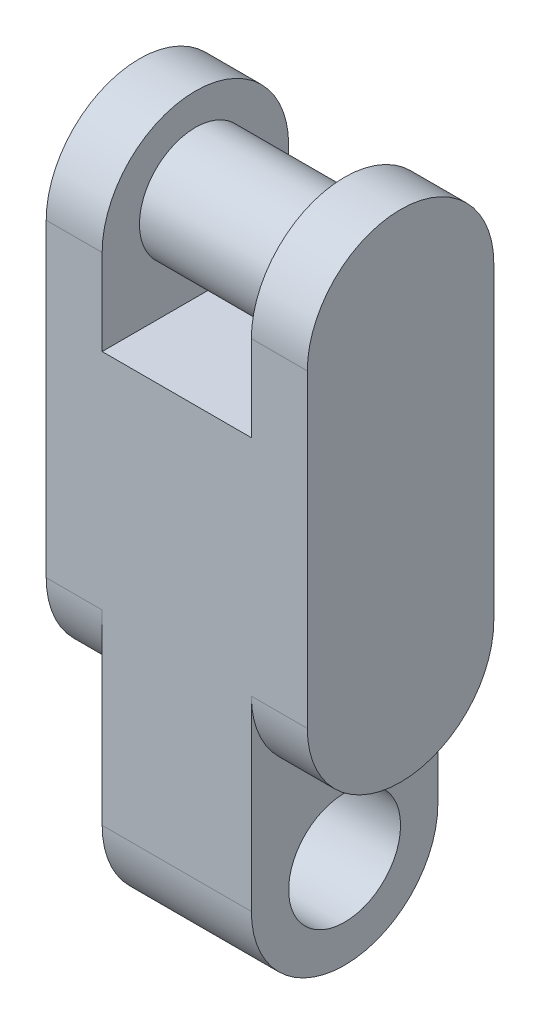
ISO-10303-21;
HEADER;
FILE_DESCRIPTION(('STEP AP214'),'2;1');
FILE_NAME('part.step','',(''),(''),'','','');
FILE_SCHEMA(('AUTOMOTIVE_DESIGN { 1 0 10303 214 1 1 1 1 }'));
ENDSEC;
DATA;
#1=APPLICATION_CONTEXT('core data for automotive mechanical design processes');
#2=APPLICATION_PROTOCOL_DEFINITION('international standard','automotive_design',2000,#1);
#3=PRODUCT_CONTEXT('',#1,'mechanical');
#4=PRODUCT('Part','Part','',(#3));
#5=PRODUCT_RELATED_PRODUCT_CATEGORY('part','',(#4));
#6=PRODUCT_DEFINITION_FORMATION('','',#4);
#7=PRODUCT_DEFINITION_CONTEXT('part definition',#1,'design');
#8=PRODUCT_DEFINITION('design','',#6,#7);
#9=PRODUCT_DEFINITION_SHAPE('','',#8);
#10=(LENGTH_UNIT() NAMED_UNIT(*) SI_UNIT(.MILLI.,.METRE.));
#11=(NAMED_UNIT(*) PLANE_ANGLE_UNIT() SI_UNIT($,.RADIAN.));
#12=(NAMED_UNIT(*) SI_UNIT($,.STERADIAN.) SOLID_ANGLE_UNIT());
#13=UNCERTAINTY_MEASURE_WITH_UNIT(LENGTH_MEASURE(1.E-05),#10,'distance_accuracy_value','');
#14=(GEOMETRIC_REPRESENTATION_CONTEXT(3) GLOBAL_UNCERTAINTY_ASSIGNED_CONTEXT((#13)) GLOBAL_UNIT_ASSIGNED_CONTEXT((#10,
#11,#12)) REPRESENTATION_CONTEXT('',''));
#15=CARTESIAN_POINT('',(0.,0.,0.));
#16=DIRECTION('',(0.,0.,1.));
#17=DIRECTION('',(1.,0.,0.));
#18=AXIS2_PLACEMENT_3D('',#15,#16,#17);
#19=CARTESIAN_POINT('',(-44.9450143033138,10.4453041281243,10.));
#20=DIRECTION('',(-1.,0.,0.));
#21=DIRECTION('',(0.,0.,1.));
#22=AXIS2_PLACEMENT_3D('',#19,#20,#21);
#23=PLANE('',#22);
#24=CARTESIAN_POINT('',(-44.9450143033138,15.4453041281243,5.));
#25=DIRECTION('',(1.,0.,0.));
#26=DIRECTION('',(0.,0.,-1.));
#27=AXIS2_PLACEMENT_3D('',#24,#25,#26);
#28=CIRCLE('',#27,5.);
#29=CARTESIAN_POINT('',(-44.9450143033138,15.4453041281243,10.));
#30=VERTEX_POINT('',#29);
#31=CARTESIAN_POINT('',(-44.9450143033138,15.4453041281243,0.));
#32=VERTEX_POINT('',#31);
#33=EDGE_CURVE('E219',#30,#32,#28,.T.);
#34=ORIENTED_EDGE('',*,*,#33,.T.);
#35=DIRECTION('',(0.,1.,0.));
#36=VECTOR('',#35,1.);
#37=CARTESIAN_POINT('',(-44.9450143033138,10.4453041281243,0.));
#38=LINE('',#37,#36);
#39=CARTESIAN_POINT('',(-44.9450143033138,32.0453041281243,0.));
#40=VERTEX_POINT('',#39);
#41=EDGE_CURVE('E152',#32,#40,#38,.T.);
#42=ORIENTED_EDGE('',*,*,#41,.T.);
#43=CARTESIAN_POINT('',(-44.9450143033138,32.0453041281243,5.));
#44=DIRECTION('',(-1.,0.,0.));
#45=DIRECTION('',(0.,0.,1.));
#46=AXIS2_PLACEMENT_3D('',#43,#44,#45);
#47=CIRCLE('',#46,5.);
#48=CARTESIAN_POINT('',(-44.9450143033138,32.0453041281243,10.));
#49=VERTEX_POINT('',#48);
#50=EDGE_CURVE('E321',#49,#40,#47,.T.);
#51=ORIENTED_EDGE('',*,*,#50,.F.);
#52=DIRECTION('',(0.,1.,0.));
#53=VECTOR('',#52,1.);
#54=CARTESIAN_POINT('',(-44.9450143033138,10.4453041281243,10.));
#55=LINE('',#54,#53);
#56=EDGE_CURVE('E221',#30,#49,#55,.T.);
#57=ORIENTED_EDGE('',*,*,#56,.F.);
#58=EDGE_LOOP('',(#34,#42,#51,#57));
#59=FACE_BOUND('',#58,.T.);
#60=ADVANCED_FACE('F129',(#59),#23,.F.);
#61=CARTESIAN_POINT('',(-58.9450143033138,37.0453041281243,10.));
#62=DIRECTION('',(1.,0.,0.));
#63=DIRECTION('',(0.,0.,-1.));
#64=AXIS2_PLACEMENT_3D('',#61,#62,#63);
#65=PLANE('',#64);
#66=CARTESIAN_POINT('',(-58.9450143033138,15.4453041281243,5.));
#67=DIRECTION('',(-1.,0.,0.));
#68=DIRECTION('',(0.,0.,1.));
#69=AXIS2_PLACEMENT_3D('',#66,#67,#68);
#70=CIRCLE('',#69,5.);
#71=CARTESIAN_POINT('',(-58.9450143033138,15.4453041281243,0.));
#72=VERTEX_POINT('',#71);
#73=CARTESIAN_POINT('',(-58.9450143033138,15.4453041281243,10.));
#74=VERTEX_POINT('',#73);
#75=EDGE_CURVE('E282',#72,#74,#70,.T.);
#76=ORIENTED_EDGE('',*,*,#75,.T.);
#77=DIRECTION('',(0.,-1.,0.));
#78=VECTOR('',#77,1.);
#79=CARTESIAN_POINT('',(-58.9450143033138,37.0453041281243,10.));
#80=LINE('',#79,#78);
#81=CARTESIAN_POINT('',(-58.9450143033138,32.0453041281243,10.));
#82=VERTEX_POINT('',#81);
#83=EDGE_CURVE('E250',#82,#74,#80,.T.);
#84=ORIENTED_EDGE('',*,*,#83,.F.);
#85=CARTESIAN_POINT('',(-58.9450143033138,32.0453041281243,5.));
#86=DIRECTION('',(-1.,0.,0.));
#87=DIRECTION('',(0.,0.,1.));
#88=AXIS2_PLACEMENT_3D('',#85,#86,#87);
#89=CIRCLE('',#88,5.);
#90=CARTESIAN_POINT('',(-58.9450143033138,32.0453041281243,0.));
#91=VERTEX_POINT('',#90);
#92=EDGE_CURVE('E280',#82,#91,#89,.T.);
#93=ORIENTED_EDGE('',*,*,#92,.T.);
#94=DIRECTION('',(0.,-1.,0.));
#95=VECTOR('',#94,1.);
#96=CARTESIAN_POINT('',(-58.9450143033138,37.0453041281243,0.));
#97=LINE('',#96,#95);
#98=EDGE_CURVE('E300',#91,#72,#97,.T.);
#99=ORIENTED_EDGE('',*,*,#98,.T.);
#100=EDGE_LOOP('',(#76,#84,#93,#99));
#101=FACE_BOUND('',#100,.T.);
#102=ADVANCED_FACE('F131',(#101),#65,.F.);
#103=CARTESIAN_POINT('',(0.,0.,10.));
#104=DIRECTION('',(0.,0.,-1.));
#105=DIRECTION('',(-1.,0.,0.));
#106=AXIS2_PLACEMENT_3D('',#103,#104,#105);
#107=PLANE('',#106);
#108=DIRECTION('',(0.,1.,0.));
#109=VECTOR('',#108,1.);
#110=CARTESIAN_POINT('',(-47.9450143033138,10.4453041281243,10.));
#111=LINE('',#110,#109);
#112=CARTESIAN_POINT('',(-47.9450143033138,5.44530412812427,10.));
#113=VERTEX_POINT('',#112);
#114=CARTESIAN_POINT('',(-47.9450143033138,15.4453041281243,10.));
#115=VERTEX_POINT('',#114);
#116=EDGE_CURVE('E287',#113,#115,#111,.T.);
#117=ORIENTED_EDGE('',*,*,#116,.T.);
#118=DIRECTION('',(1.,0.,0.));
#119=VECTOR('',#118,1.);
#120=CARTESIAN_POINT('',(-47.9450143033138,15.4453041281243,10.));
#121=LINE('',#120,#119);
#122=EDGE_CURVE('E348',#115,#30,#121,.T.);
#123=ORIENTED_EDGE('',*,*,#122,.T.);
#124=ORIENTED_EDGE('',*,*,#56,.T.);
#125=DIRECTION('',(-1.,0.,0.));
#126=VECTOR('',#125,1.);
#127=CARTESIAN_POINT('',(-37.9450143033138,32.0453041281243,10.));
#128=LINE('',#127,#126);
#129=CARTESIAN_POINT('',(-47.9450143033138,32.0453041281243,10.));
#130=VERTEX_POINT('',#129);
#131=EDGE_CURVE('E12',#49,#130,#128,.T.);
#132=ORIENTED_EDGE('',*,*,#131,.T.);
#133=DIRECTION('',(0.,-1.,0.));
#134=VECTOR('',#133,1.);
#135=CARTESIAN_POINT('',(-47.9450143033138,27.446470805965,10.));
#136=LINE('',#135,#134);
#137=CARTESIAN_POINT('',(-47.9450143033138,27.446470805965,10.));
#138=VERTEX_POINT('',#137);
#139=EDGE_CURVE('E295',#130,#138,#136,.T.);
#140=ORIENTED_EDGE('',*,*,#139,.T.);
#141=DIRECTION('',(-1.,0.,0.));
#142=VECTOR('',#141,1.);
#143=CARTESIAN_POINT('',(-55.9450143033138,27.446470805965,10.));
#144=LINE('',#143,#142);
#145=CARTESIAN_POINT('',(-55.9450143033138,27.446470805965,10.));
#146=VERTEX_POINT('',#145);
#147=EDGE_CURVE('E297',#138,#146,#144,.T.);
#148=ORIENTED_EDGE('',*,*,#147,.T.);
#149=DIRECTION('',(0.,1.,0.));
#150=VECTOR('',#149,1.);
#151=CARTESIAN_POINT('',(-55.9450143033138,37.0453041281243,10.));
#152=LINE('',#151,#150);
#153=CARTESIAN_POINT('',(-55.9450143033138,32.0453041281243,10.));
#154=VERTEX_POINT('',#153);
#155=EDGE_CURVE('E255',#146,#154,#152,.T.);
#156=ORIENTED_EDGE('',*,*,#155,.T.);
#157=EDGE_CURVE('E133',#154,#82,#128,.T.);
#158=ORIENTED_EDGE('',*,*,#157,.T.);
#159=ORIENTED_EDGE('',*,*,#83,.T.);
#160=DIRECTION('',(-1.,0.,0.));
#161=VECTOR('',#160,1.);
#162=CARTESIAN_POINT('',(-55.9450143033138,15.4453041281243,10.));
#163=LINE('',#162,#161);
#164=CARTESIAN_POINT('',(-55.9450143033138,15.4453041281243,10.));
#165=VERTEX_POINT('',#164);
#166=EDGE_CURVE('E347',#165,#74,#163,.T.);
#167=ORIENTED_EDGE('',*,*,#166,.F.);
#168=DIRECTION('',(0.,-1.,0.));
#169=VECTOR('',#168,1.);
#170=CARTESIAN_POINT('',(-55.9450143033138,0.445304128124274,10.));
#171=LINE('',#170,#169);
#172=CARTESIAN_POINT('',(-55.9450143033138,5.44530412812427,10.));
#173=VERTEX_POINT('',#172);
#174=EDGE_CURVE('E284',#165,#173,#171,.T.);
#175=ORIENTED_EDGE('',*,*,#174,.T.);
#176=DIRECTION('',(1.,0.,0.));
#177=VECTOR('',#176,1.);
#178=CARTESIAN_POINT('',(-55.9450143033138,5.44530412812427,10.));
#179=LINE('',#178,#177);
#180=EDGE_CURVE('E328',#173,#113,#179,.T.);
#181=ORIENTED_EDGE('',*,*,#180,.T.);
#182=EDGE_LOOP('',(#117,#123,#124,#132,#140,#148,#156,#158,#159,#167,#175,#181));
#183=FACE_BOUND('',#182,.T.);
#184=ADVANCED_FACE('F275',(#183),#107,.F.);
#185=CARTESIAN_POINT('',(0.,0.,0.));
#186=DIRECTION('',(0.,0.,-1.));
#187=DIRECTION('',(-1.,0.,0.));
#188=AXIS2_PLACEMENT_3D('',#185,#186,#187);
#189=PLANE('',#188);
#190=DIRECTION('',(1.,0.,0.));
#191=VECTOR('',#190,1.);
#192=CARTESIAN_POINT('',(-47.9450143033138,15.4453041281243,0.));
#193=LINE('',#192,#191);
#194=CARTESIAN_POINT('',(-47.9450143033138,15.4453041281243,0.));
#195=VERTEX_POINT('',#194);
#196=EDGE_CURVE('E226',#195,#32,#193,.T.);
#197=ORIENTED_EDGE('',*,*,#196,.F.);
#198=DIRECTION('',(0.,1.,0.));
#199=VECTOR('',#198,1.);
#200=CARTESIAN_POINT('',(-47.9450143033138,10.4453041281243,0.));
#201=LINE('',#200,#199);
#202=CARTESIAN_POINT('',(-47.9450143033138,5.44530412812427,0.));
#203=VERTEX_POINT('',#202);
#204=EDGE_CURVE('E239',#203,#195,#201,.T.);
#205=ORIENTED_EDGE('',*,*,#204,.F.);
#206=DIRECTION('',(1.,0.,0.));
#207=VECTOR('',#206,1.);
#208=CARTESIAN_POINT('',(-55.9450143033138,5.44530412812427,0.));
#209=LINE('',#208,#207);
#210=CARTESIAN_POINT('',(-55.9450143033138,5.44530412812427,0.));
#211=VERTEX_POINT('',#210);
#212=EDGE_CURVE('E323',#211,#203,#209,.T.);
#213=ORIENTED_EDGE('',*,*,#212,.F.);
#214=DIRECTION('',(0.,-1.,0.));
#215=VECTOR('',#214,1.);
#216=CARTESIAN_POINT('',(-55.9450143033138,0.445304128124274,0.));
#217=LINE('',#216,#215);
#218=CARTESIAN_POINT('',(-55.9450143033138,15.4453041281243,0.));
#219=VERTEX_POINT('',#218);
#220=EDGE_CURVE('E144',#219,#211,#217,.T.);
#221=ORIENTED_EDGE('',*,*,#220,.F.);
#222=DIRECTION('',(-1.,0.,0.));
#223=VECTOR('',#222,1.);
#224=CARTESIAN_POINT('',(-55.9450143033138,15.4453041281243,0.));
#225=LINE('',#224,#223);
#226=EDGE_CURVE('E310',#219,#72,#225,.T.);
#227=ORIENTED_EDGE('',*,*,#226,.T.);
#228=ORIENTED_EDGE('',*,*,#98,.F.);
#229=DIRECTION('',(-1.,0.,0.));
#230=VECTOR('',#229,1.);
#231=CARTESIAN_POINT('',(-37.9450143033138,32.0453041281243,0.));
#232=LINE('',#231,#230);
#233=CARTESIAN_POINT('',(-55.9450143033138,32.0453041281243,0.));
#234=VERTEX_POINT('',#233);
#235=EDGE_CURVE('E263',#234,#91,#232,.T.);
#236=ORIENTED_EDGE('',*,*,#235,.F.);
#237=DIRECTION('',(0.,1.,0.));
#238=VECTOR('',#237,1.);
#239=CARTESIAN_POINT('',(-55.9450143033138,37.0453041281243,0.));
#240=LINE('',#239,#238);
#241=CARTESIAN_POINT('',(-55.9450143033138,27.446470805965,0.));
#242=VERTEX_POINT('',#241);
#243=EDGE_CURVE('E247',#242,#234,#240,.T.);
#244=ORIENTED_EDGE('',*,*,#243,.F.);
#245=DIRECTION('',(-1.,0.,0.));
#246=VECTOR('',#245,1.);
#247=CARTESIAN_POINT('',(-55.9450143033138,27.446470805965,0.));
#248=LINE('',#247,#246);
#249=CARTESIAN_POINT('',(-47.9450143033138,27.446470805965,0.));
#250=VERTEX_POINT('',#249);
#251=EDGE_CURVE('E241',#250,#242,#248,.T.);
#252=ORIENTED_EDGE('',*,*,#251,.F.);
#253=DIRECTION('',(0.,-1.,0.));
#254=VECTOR('',#253,1.);
#255=CARTESIAN_POINT('',(-47.9450143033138,27.446470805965,0.));
#256=LINE('',#255,#254);
#257=CARTESIAN_POINT('',(-47.9450143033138,32.0453041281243,0.));
#258=VERTEX_POINT('',#257);
#259=EDGE_CURVE('E238',#258,#250,#256,.T.);
#260=ORIENTED_EDGE('',*,*,#259,.F.);
#261=EDGE_CURVE('E237',#40,#258,#232,.T.);
#262=ORIENTED_EDGE('',*,*,#261,.F.);
#263=ORIENTED_EDGE('',*,*,#41,.F.);
#264=EDGE_LOOP('',(#197,#205,#213,#221,#227,#228,#236,#244,#252,#260,#262,#263));
#265=FACE_BOUND('',#264,.T.);
#266=ADVANCED_FACE('F235',(#265),#189,.T.);
#267=CARTESIAN_POINT('',(-47.9450143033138,27.446470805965,10.));
#268=DIRECTION('',(1.,0.,0.));
#269=DIRECTION('',(0.,0.,-1.));
#270=AXIS2_PLACEMENT_3D('',#267,#268,#269);
#271=PLANE('',#270);
#272=CARTESIAN_POINT('',(-47.9450143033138,32.3539598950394,5.));
#273=DIRECTION('',(1.,0.,0.));
#274=DIRECTION('',(0.,0.,-1.));
#275=AXIS2_PLACEMENT_3D('',#272,#273,#274);
#276=CIRCLE('',#275,3.);
#277=CARTESIAN_POINT('',(-47.9450143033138,32.3539598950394,2.));
#278=VERTEX_POINT('',#277);
#279=EDGE_CURVE('E261',#278,#278,#276,.F.);
#280=ORIENTED_EDGE('',*,*,#279,.F.);
#281=EDGE_LOOP('',(#280));
#282=FACE_BOUND('',#281,.T.);
#283=ORIENTED_EDGE('',*,*,#139,.F.);
#284=CARTESIAN_POINT('',(-47.9450143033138,32.0453041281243,5.));
#285=DIRECTION('',(1.,0.,0.));
#286=DIRECTION('',(0.,0.,-1.));
#287=AXIS2_PLACEMENT_3D('',#284,#285,#286);
#288=CIRCLE('',#287,5.);
#289=EDGE_CURVE('E319',#258,#130,#288,.T.);
#290=ORIENTED_EDGE('',*,*,#289,.F.);
#291=ORIENTED_EDGE('',*,*,#259,.T.);
#292=DIRECTION('',(0.,0.,-1.));
#293=VECTOR('',#292,1.);
#294=CARTESIAN_POINT('',(-47.9450143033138,27.446470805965,10.));
#295=LINE('',#294,#293);
#296=EDGE_CURVE('E254',#138,#250,#295,.T.);
#297=ORIENTED_EDGE('',*,*,#296,.F.);
#298=EDGE_LOOP('',(#283,#290,#291,#297));
#299=FACE_BOUND('',#298,.T.);
#300=ADVANCED_FACE('F356',(#282,#299),#271,.F.);
#301=CARTESIAN_POINT('',(-55.9450143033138,37.0453041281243,10.));
#302=DIRECTION('',(-1.,0.,0.));
#303=DIRECTION('',(0.,0.,1.));
#304=AXIS2_PLACEMENT_3D('',#301,#302,#303);
#305=PLANE('',#304);
#306=CARTESIAN_POINT('',(-55.9450143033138,32.3539598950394,5.));
#307=DIRECTION('',(-1.,0.,0.));
#308=DIRECTION('',(0.,0.,1.));
#309=AXIS2_PLACEMENT_3D('',#306,#307,#308);
#310=CIRCLE('',#309,3.);
#311=CARTESIAN_POINT('',(-55.9450143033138,32.3539598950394,8.));
#312=VERTEX_POINT('',#311);
#313=EDGE_CURVE('E258',#312,#312,#310,.F.);
#314=ORIENTED_EDGE('',*,*,#313,.F.);
#315=EDGE_LOOP('',(#314));
#316=FACE_BOUND('',#315,.T.);
#317=CARTESIAN_POINT('',(-55.9450143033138,32.0453041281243,5.));
#318=DIRECTION('',(-1.,0.,0.));
#319=DIRECTION('',(0.,0.,1.));
#320=AXIS2_PLACEMENT_3D('',#317,#318,#319);
#321=CIRCLE('',#320,5.);
#322=EDGE_CURVE('E314',#154,#234,#321,.T.);
#323=ORIENTED_EDGE('',*,*,#322,.F.);
#324=ORIENTED_EDGE('',*,*,#155,.F.);
#325=DIRECTION('',(0.,0.,-1.));
#326=VECTOR('',#325,1.);
#327=CARTESIAN_POINT('',(-55.9450143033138,27.446470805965,10.));
#328=LINE('',#327,#326);
#329=EDGE_CURVE('E251',#146,#242,#328,.T.);
#330=ORIENTED_EDGE('',*,*,#329,.T.);
#331=ORIENTED_EDGE('',*,*,#243,.T.);
#332=EDGE_LOOP('',(#323,#324,#330,#331));
#333=FACE_BOUND('',#332,.T.);
#334=ADVANCED_FACE('F364',(#316,#333),#305,.F.);
#335=CARTESIAN_POINT('',(-55.9450143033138,0.445304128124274,10.));
#336=DIRECTION('',(1.,0.,0.));
#337=DIRECTION('',(0.,0.,-1.));
#338=AXIS2_PLACEMENT_3D('',#335,#336,#337);
#339=PLANE('',#338);
#340=CARTESIAN_POINT('',(-55.9450143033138,5.44530412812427,5.));
#341=DIRECTION('',(1.,0.,0.));
#342=DIRECTION('',(0.,0.,-1.));
#343=AXIS2_PLACEMENT_3D('',#340,#341,#342);
#344=CIRCLE('',#343,3.);
#345=CARTESIAN_POINT('',(-55.9450143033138,5.44530412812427,2.));
#346=VERTEX_POINT('',#345);
#347=EDGE_CURVE('E301',#346,#346,#344,.T.);
#348=ORIENTED_EDGE('',*,*,#347,.T.);
#349=EDGE_LOOP('',(#348));
#350=FACE_BOUND('',#349,.T.);
#351=ORIENTED_EDGE('',*,*,#220,.T.);
#352=CARTESIAN_POINT('',(-55.9450143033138,5.44530412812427,5.));
#353=DIRECTION('',(1.,0.,0.));
#354=DIRECTION('',(0.,0.,-1.));
#355=AXIS2_PLACEMENT_3D('',#352,#353,#354);
#356=CIRCLE('',#355,5.);
#357=EDGE_CURVE('E305',#173,#211,#356,.T.);
#358=ORIENTED_EDGE('',*,*,#357,.F.);
#359=ORIENTED_EDGE('',*,*,#174,.F.);
#360=CARTESIAN_POINT('',(-55.9450143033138,15.4453041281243,5.));
#361=DIRECTION('',(-1.,0.,0.));
#362=DIRECTION('',(0.,0.,1.));
#363=AXIS2_PLACEMENT_3D('',#360,#361,#362);
#364=CIRCLE('',#363,5.);
#365=EDGE_CURVE('E307',#219,#165,#364,.T.);
#366=ORIENTED_EDGE('',*,*,#365,.F.);
#367=EDGE_LOOP('',(#351,#358,#359,#366));
#368=FACE_BOUND('',#367,.T.);
#369=ADVANCED_FACE('F304',(#350,#368),#339,.F.);
#370=CARTESIAN_POINT('',(-47.9450143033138,10.4453041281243,10.));
#371=DIRECTION('',(-1.,0.,0.));
#372=DIRECTION('',(0.,0.,1.));
#373=AXIS2_PLACEMENT_3D('',#370,#371,#372);
#374=PLANE('',#373);
#375=CARTESIAN_POINT('',(-47.9450143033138,5.44530412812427,5.));
#376=DIRECTION('',(1.,0.,0.));
#377=DIRECTION('',(0.,0.,-1.));
#378=AXIS2_PLACEMENT_3D('',#375,#376,#377);
#379=CIRCLE('',#378,3.);
#380=CARTESIAN_POINT('',(-47.9450143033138,5.44530412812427,2.));
#381=VERTEX_POINT('',#380);
#382=EDGE_CURVE('E290',#381,#381,#379,.T.);
#383=ORIENTED_EDGE('',*,*,#382,.F.);
#384=EDGE_LOOP('',(#383));
#385=FACE_BOUND('',#384,.T.);
#386=CARTESIAN_POINT('',(-47.9450143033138,5.44530412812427,5.));
#387=DIRECTION('',(1.,0.,0.));
#388=DIRECTION('',(0.,0.,-1.));
#389=AXIS2_PLACEMENT_3D('',#386,#387,#388);
#390=CIRCLE('',#389,5.);
#391=EDGE_CURVE('E326',#113,#203,#390,.T.);
#392=ORIENTED_EDGE('',*,*,#391,.T.);
#393=ORIENTED_EDGE('',*,*,#204,.T.);
#394=CARTESIAN_POINT('',(-47.9450143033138,15.4453041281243,5.));
#395=DIRECTION('',(1.,0.,0.));
#396=DIRECTION('',(0.,0.,-1.));
#397=AXIS2_PLACEMENT_3D('',#394,#395,#396);
#398=CIRCLE('',#397,5.);
#399=EDGE_CURVE('E225',#115,#195,#398,.T.);
#400=ORIENTED_EDGE('',*,*,#399,.F.);
#401=ORIENTED_EDGE('',*,*,#116,.F.);
#402=EDGE_LOOP('',(#392,#393,#400,#401));
#403=FACE_BOUND('',#402,.T.);
#404=ADVANCED_FACE('F339',(#385,#403),#374,.F.);
#405=CARTESIAN_POINT('',(-55.9450143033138,27.446470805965,10.));
#406=DIRECTION('',(0.,-1.,0.));
#407=DIRECTION('',(0.,0.,-1.));
#408=AXIS2_PLACEMENT_3D('',#405,#406,#407);
#409=PLANE('',#408);
#410=ORIENTED_EDGE('',*,*,#251,.T.);
#411=ORIENTED_EDGE('',*,*,#329,.F.);
#412=ORIENTED_EDGE('',*,*,#147,.F.);
#413=ORIENTED_EDGE('',*,*,#296,.T.);
#414=EDGE_LOOP('',(#410,#411,#412,#413));
#415=FACE_BOUND('',#414,.T.);
#416=ADVANCED_FACE('F342',(#415),#409,.F.);
#417=CARTESIAN_POINT('',(-55.9450143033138,32.3539598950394,5.));
#418=DIRECTION('',(1.,0.,0.));
#419=DIRECTION('',(0.,0.,-1.));
#420=AXIS2_PLACEMENT_3D('',#417,#418,#419);
#421=CYLINDRICAL_SURFACE('',#420,3.);
#422=ORIENTED_EDGE('',*,*,#313,.T.);
#423=EDGE_LOOP('',(#422));
#424=FACE_BOUND('',#423,.T.);
#425=ORIENTED_EDGE('',*,*,#279,.T.);
#426=EDGE_LOOP('',(#425));
#427=FACE_BOUND('',#426,.T.);
#428=ADVANCED_FACE('F398',(#424,#427),#421,.T.);
#429=CARTESIAN_POINT('',(-55.9450143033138,5.44530412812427,5.));
#430=DIRECTION('',(1.,0.,0.));
#431=DIRECTION('',(0.,0.,-1.));
#432=AXIS2_PLACEMENT_3D('',#429,#430,#431);
#433=CYLINDRICAL_SURFACE('',#432,3.);
#434=ORIENTED_EDGE('',*,*,#347,.F.);
#435=EDGE_LOOP('',(#434));
#436=FACE_BOUND('',#435,.T.);
#437=ORIENTED_EDGE('',*,*,#382,.T.);
#438=EDGE_LOOP('',(#437));
#439=FACE_BOUND('',#438,.T.);
#440=ADVANCED_FACE('F337',(#436,#439),#433,.F.);
#441=CARTESIAN_POINT('',(-55.9450143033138,5.44530412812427,5.));
#442=DIRECTION('',(1.,0.,0.));
#443=DIRECTION('',(0.,0.,-1.));
#444=AXIS2_PLACEMENT_3D('',#441,#442,#443);
#445=CYLINDRICAL_SURFACE('',#444,5.);
#446=ORIENTED_EDGE('',*,*,#391,.F.);
#447=ORIENTED_EDGE('',*,*,#180,.F.);
#448=ORIENTED_EDGE('',*,*,#357,.T.);
#449=ORIENTED_EDGE('',*,*,#212,.T.);
#450=EDGE_LOOP('',(#446,#447,#448,#449));
#451=FACE_BOUND('',#450,.T.);
#452=ADVANCED_FACE('F346',(#451),#445,.T.);
#453=CARTESIAN_POINT('',(-37.9450143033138,32.0453041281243,5.));
#454=DIRECTION('',(-1.,0.,0.));
#455=DIRECTION('',(0.,0.,1.));
#456=AXIS2_PLACEMENT_3D('',#453,#454,#455);
#457=CYLINDRICAL_SURFACE('',#456,5.);
#458=ORIENTED_EDGE('',*,*,#322,.T.);
#459=ORIENTED_EDGE('',*,*,#235,.T.);
#460=ORIENTED_EDGE('',*,*,#92,.F.);
#461=ORIENTED_EDGE('',*,*,#157,.F.);
#462=EDGE_LOOP('',(#458,#459,#460,#461));
#463=FACE_BOUND('',#462,.T.);
#464=ADVANCED_FACE('F365',(#463),#457,.T.);
#465=ORIENTED_EDGE('',*,*,#50,.T.);
#466=ORIENTED_EDGE('',*,*,#261,.T.);
#467=ORIENTED_EDGE('',*,*,#289,.T.);
#468=ORIENTED_EDGE('',*,*,#131,.F.);
#469=EDGE_LOOP('',(#465,#466,#467,#468));
#470=FACE_BOUND('',#469,.T.);
#471=ADVANCED_FACE('F354',(#470),#457,.T.);
#472=CARTESIAN_POINT('',(-55.9450143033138,15.4453041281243,5.));
#473=DIRECTION('',(-1.,0.,0.));
#474=DIRECTION('',(0.,0.,1.));
#475=AXIS2_PLACEMENT_3D('',#472,#473,#474);
#476=CYLINDRICAL_SURFACE('',#475,5.);
#477=ORIENTED_EDGE('',*,*,#75,.F.);
#478=ORIENTED_EDGE('',*,*,#226,.F.);
#479=ORIENTED_EDGE('',*,*,#365,.T.);
#480=ORIENTED_EDGE('',*,*,#166,.T.);
#481=EDGE_LOOP('',(#477,#478,#479,#480));
#482=FACE_BOUND('',#481,.T.);
#483=ADVANCED_FACE('F312',(#482),#476,.T.);
#484=CARTESIAN_POINT('',(-47.9450143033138,15.4453041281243,5.));
#485=DIRECTION('',(1.,0.,0.));
#486=DIRECTION('',(0.,0.,-1.));
#487=AXIS2_PLACEMENT_3D('',#484,#485,#486);
#488=CYLINDRICAL_SURFACE('',#487,5.);
#489=ORIENTED_EDGE('',*,*,#33,.F.);
#490=ORIENTED_EDGE('',*,*,#122,.F.);
#491=ORIENTED_EDGE('',*,*,#399,.T.);
#492=ORIENTED_EDGE('',*,*,#196,.T.);
#493=EDGE_LOOP('',(#489,#490,#491,#492));
#494=FACE_BOUND('',#493,.T.);
#495=ADVANCED_FACE('F230',(#494),#488,.T.);
#496=CLOSED_SHELL('',(#60,#102,#184,#266,#300,#334,#369,#404,#416,#428,#440,#452,#464,#471,#483,#495));
#497=MANIFOLD_SOLID_BREP('B2',#496);
#498=ADVANCED_BREP_SHAPE_REPRESENTATION('',(#18,#497),#14);
#499=SHAPE_DEFINITION_REPRESENTATION(#9,#498);
ENDSEC;
END-ISO-10303-21;
